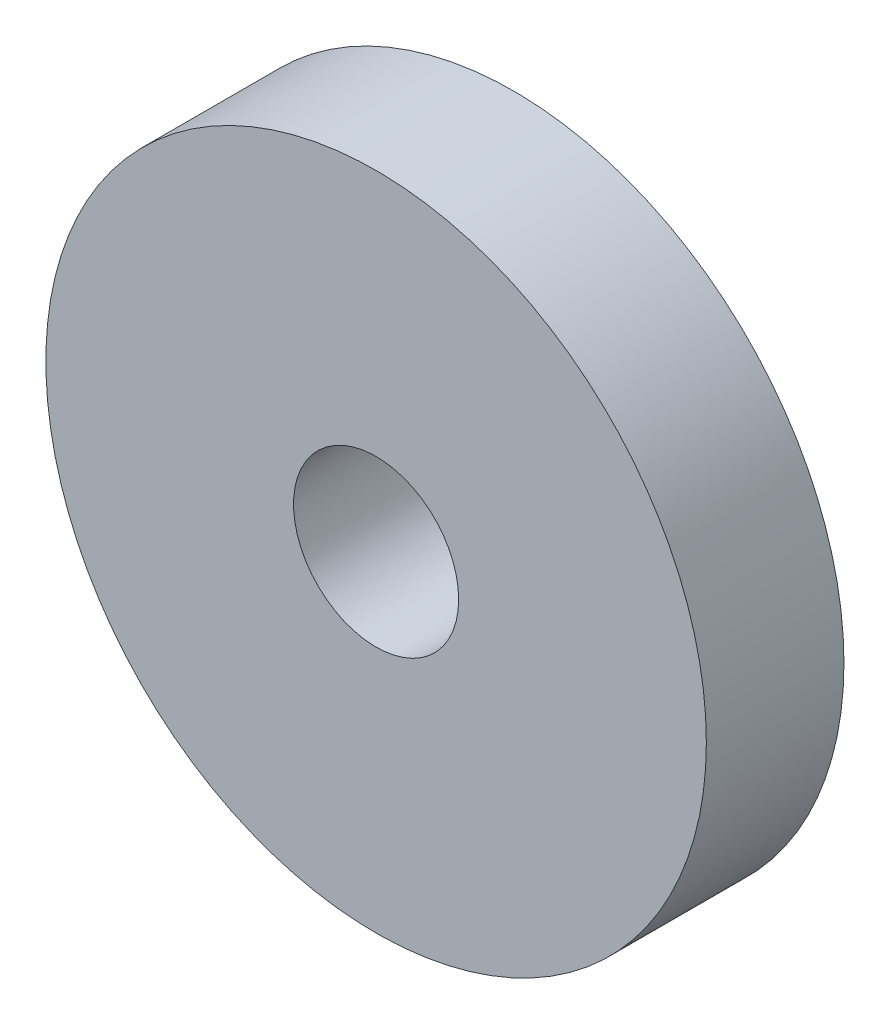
ISO-10303-21;
HEADER;
FILE_DESCRIPTION(('STEP AP214'),'2;1');
FILE_NAME('part.step','',(''),(''),'','','');
FILE_SCHEMA(('AUTOMOTIVE_DESIGN { 1 0 10303 214 1 1 1 1 }'));
ENDSEC;
DATA;
#1=APPLICATION_CONTEXT('core data for automotive mechanical design processes');
#2=APPLICATION_PROTOCOL_DEFINITION('international standard','automotive_design',2000,#1);
#3=PRODUCT_CONTEXT('',#1,'mechanical');
#4=PRODUCT('Part','Part','',(#3));
#5=PRODUCT_RELATED_PRODUCT_CATEGORY('part','',(#4));
#6=PRODUCT_DEFINITION_FORMATION('','',#4);
#7=PRODUCT_DEFINITION_CONTEXT('part definition',#1,'design');
#8=PRODUCT_DEFINITION('design','',#6,#7);
#9=PRODUCT_DEFINITION_SHAPE('','',#8);
#10=(LENGTH_UNIT() NAMED_UNIT(*) SI_UNIT(.MILLI.,.METRE.));
#11=(NAMED_UNIT(*) PLANE_ANGLE_UNIT() SI_UNIT($,.RADIAN.));
#12=(NAMED_UNIT(*) SI_UNIT($,.STERADIAN.) SOLID_ANGLE_UNIT());
#13=UNCERTAINTY_MEASURE_WITH_UNIT(LENGTH_MEASURE(1.E-05),#10,'distance_accuracy_value','');
#14=(GEOMETRIC_REPRESENTATION_CONTEXT(3) GLOBAL_UNCERTAINTY_ASSIGNED_CONTEXT((#13)) GLOBAL_UNIT_ASSIGNED_CONTEXT((#10,
#11,#12)) REPRESENTATION_CONTEXT('',''));
#15=CARTESIAN_POINT('',(0.,0.,0.));
#16=DIRECTION('',(0.,0.,1.));
#17=DIRECTION('',(1.,0.,0.));
#18=AXIS2_PLACEMENT_3D('',#15,#16,#17);
#19=CARTESIAN_POINT('',(0.,0.,20.));
#20=DIRECTION('',(0.,0.,1.));
#21=DIRECTION('',(1.,0.,0.));
#22=AXIS2_PLACEMENT_3D('',#19,#20,#21);
#23=CYLINDRICAL_SURFACE('',#22,3.);
#24=CARTESIAN_POINT('',(0.,0.,6.));
#25=DIRECTION('',(0.,0.,1.));
#26=DIRECTION('',(1.,0.,0.));
#27=AXIS2_PLACEMENT_3D('',#24,#25,#26);
#28=CIRCLE('',#27,3.);
#29=CARTESIAN_POINT('',(3.,0.,6.));
#30=VERTEX_POINT('',#29);
#31=EDGE_CURVE('E8',#30,#30,#28,.T.);
#32=ORIENTED_EDGE('',*,*,#31,.T.);
#33=EDGE_LOOP('',(#32));
#34=FACE_BOUND('',#33,.T.);
#35=CARTESIAN_POINT('',(0.,0.,0.));
#36=DIRECTION('',(0.,0.,1.));
#37=DIRECTION('',(1.,0.,0.));
#38=AXIS2_PLACEMENT_3D('',#35,#36,#37);
#39=CIRCLE('',#38,3.);
#40=CARTESIAN_POINT('',(3.,0.,0.));
#41=VERTEX_POINT('',#40);
#42=EDGE_CURVE('E34',#41,#41,#39,.T.);
#43=ORIENTED_EDGE('',*,*,#42,.F.);
#44=EDGE_LOOP('',(#43));
#45=FACE_BOUND('',#44,.T.);
#46=ADVANCED_FACE('F12',(#34,#45),#23,.F.);
#47=CARTESIAN_POINT('',(-3.,0.,6.));
#48=DIRECTION('',(0.,0.,1.));
#49=DIRECTION('',(1.,0.,0.));
#50=AXIS2_PLACEMENT_3D('',#47,#48,#49);
#51=PLANE('',#50);
#52=CARTESIAN_POINT('',(0.,0.,6.));
#53=DIRECTION('',(0.,0.,1.));
#54=DIRECTION('',(1.,0.,0.));
#55=AXIS2_PLACEMENT_3D('',#52,#53,#54);
#56=CIRCLE('',#55,12.);
#57=CARTESIAN_POINT('',(12.,0.,6.));
#58=VERTEX_POINT('',#57);
#59=EDGE_CURVE('E18',#58,#58,#56,.T.);
#60=ORIENTED_EDGE('',*,*,#59,.T.);
#61=EDGE_LOOP('',(#60));
#62=FACE_BOUND('',#61,.T.);
#63=ORIENTED_EDGE('',*,*,#31,.F.);
#64=EDGE_LOOP('',(#63));
#65=FACE_BOUND('',#64,.T.);
#66=ADVANCED_FACE('F42',(#62,#65),#51,.T.);
#67=CARTESIAN_POINT('',(0.,0.,20.));
#68=DIRECTION('',(0.,0.,1.));
#69=DIRECTION('',(1.,0.,0.));
#70=AXIS2_PLACEMENT_3D('',#67,#68,#69);
#71=CYLINDRICAL_SURFACE('',#70,12.);
#72=CARTESIAN_POINT('',(0.,0.,1.));
#73=DIRECTION('',(0.,0.,1.));
#74=DIRECTION('',(1.,0.,0.));
#75=AXIS2_PLACEMENT_3D('',#72,#73,#74);
#76=CIRCLE('',#75,12.);
#77=CARTESIAN_POINT('',(12.,0.,1.));
#78=VERTEX_POINT('',#77);
#79=EDGE_CURVE('E22',#78,#78,#76,.T.);
#80=ORIENTED_EDGE('',*,*,#79,.T.);
#81=EDGE_LOOP('',(#80));
#82=FACE_BOUND('',#81,.T.);
#83=ORIENTED_EDGE('',*,*,#59,.F.);
#84=EDGE_LOOP('',(#83));
#85=FACE_BOUND('',#84,.T.);
#86=ADVANCED_FACE('F47',(#82,#85),#71,.T.);
#87=CARTESIAN_POINT('',(-12.,0.,1.));
#88=DIRECTION('',(0.,0.,-1.));
#89=DIRECTION('',(-1.,0.,0.));
#90=AXIS2_PLACEMENT_3D('',#87,#88,#89);
#91=PLANE('',#90);
#92=CARTESIAN_POINT('',(0.,0.,1.));
#93=DIRECTION('',(0.,0.,1.));
#94=DIRECTION('',(1.,0.,0.));
#95=AXIS2_PLACEMENT_3D('',#92,#93,#94);
#96=CIRCLE('',#95,6.);
#97=CARTESIAN_POINT('',(6.,0.,1.));
#98=VERTEX_POINT('',#97);
#99=EDGE_CURVE('E26',#98,#98,#96,.T.);
#100=ORIENTED_EDGE('',*,*,#99,.T.);
#101=EDGE_LOOP('',(#100));
#102=FACE_BOUND('',#101,.T.);
#103=ORIENTED_EDGE('',*,*,#79,.F.);
#104=EDGE_LOOP('',(#103));
#105=FACE_BOUND('',#104,.T.);
#106=ADVANCED_FACE('F51',(#102,#105),#91,.T.);
#107=CARTESIAN_POINT('',(0.,0.,20.));
#108=DIRECTION('',(0.,0.,1.));
#109=DIRECTION('',(1.,0.,0.));
#110=AXIS2_PLACEMENT_3D('',#107,#108,#109);
#111=CYLINDRICAL_SURFACE('',#110,6.);
#112=CARTESIAN_POINT('',(0.,0.,0.));
#113=DIRECTION('',(0.,0.,1.));
#114=DIRECTION('',(1.,0.,0.));
#115=AXIS2_PLACEMENT_3D('',#112,#113,#114);
#116=CIRCLE('',#115,6.);
#117=CARTESIAN_POINT('',(6.,0.,0.));
#118=VERTEX_POINT('',#117);
#119=EDGE_CURVE('E31',#118,#118,#116,.T.);
#120=ORIENTED_EDGE('',*,*,#119,.T.);
#121=EDGE_LOOP('',(#120));
#122=FACE_BOUND('',#121,.T.);
#123=ORIENTED_EDGE('',*,*,#99,.F.);
#124=EDGE_LOOP('',(#123));
#125=FACE_BOUND('',#124,.T.);
#126=ADVANCED_FACE('F58',(#122,#125),#111,.T.);
#127=CARTESIAN_POINT('',(-6.,0.,0.));
#128=DIRECTION('',(0.,0.,-1.));
#129=DIRECTION('',(-1.,0.,0.));
#130=AXIS2_PLACEMENT_3D('',#127,#128,#129);
#131=PLANE('',#130);
#132=ORIENTED_EDGE('',*,*,#42,.T.);
#133=EDGE_LOOP('',(#132));
#134=FACE_BOUND('',#133,.T.);
#135=ORIENTED_EDGE('',*,*,#119,.F.);
#136=EDGE_LOOP('',(#135));
#137=FACE_BOUND('',#136,.T.);
#138=ADVANCED_FACE('F38',(#134,#137),#131,.T.);
#139=CLOSED_SHELL('',(#46,#66,#86,#106,#126,#138));
#140=MANIFOLD_SOLID_BREP('B1',#139);
#141=ADVANCED_BREP_SHAPE_REPRESENTATION('',(#18,#140),#14);
#142=SHAPE_DEFINITION_REPRESENTATION(#9,#141);
ENDSEC;
END-ISO-10303-21;
